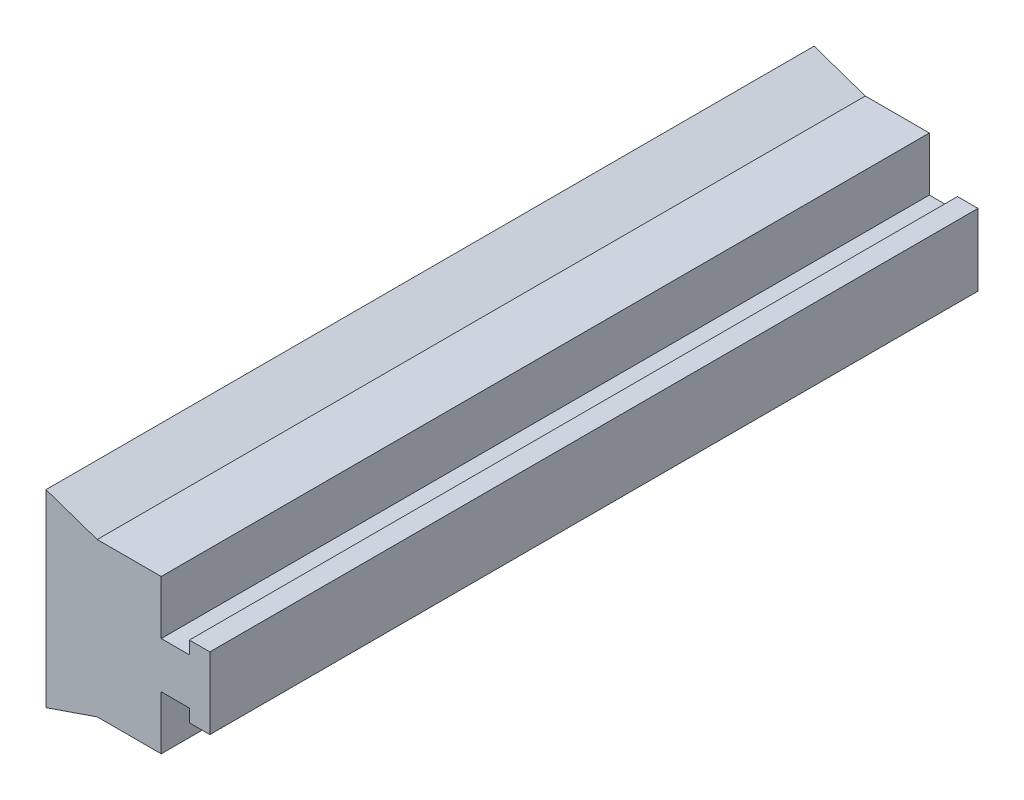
from build123d import *

# Parameters (mm, degrees)
BOSS_EXTRUDE1_DEPTH = 30


with BuildPart() as part:
    # Sketch1 → Boss-Extrude1 (new, symmetric)
    with BuildSketch(Plane.XY):
        Polygon((-6.5, -7.375), (-6.5, 7.375), (-2.5, 6), (2.5, 6), (2.5, 1.8), (4.7, 1.8), (4.7, 2.8), (6.3, 2.8), (6.3, 0), (6.3, -2.8), (4.7, -2.8), (4.7, -1.8), (2.5, -1.8), (2.5, -6), (-2.5, -6), align=None)
    extrude(amount=BOSS_EXTRUDE1_DEPTH, both=True)


solid = part.part
